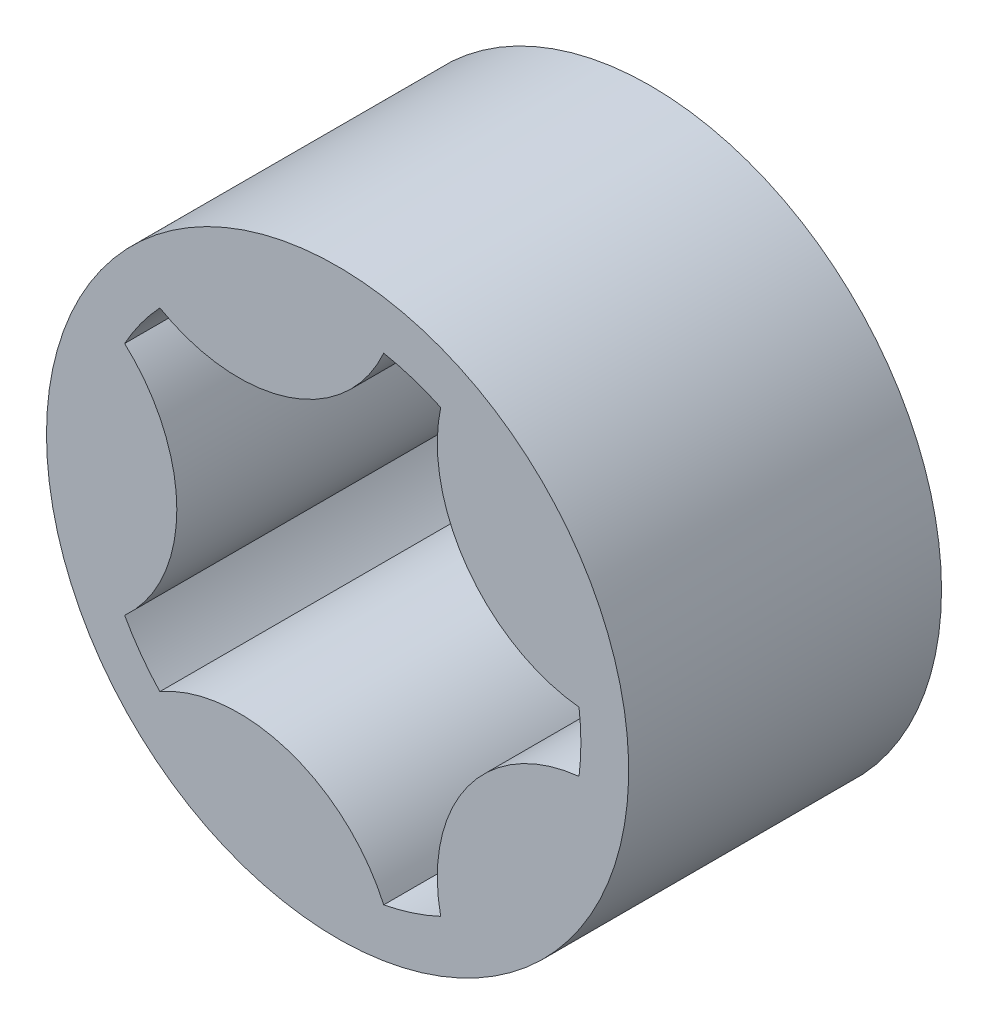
ISO-10303-21;
HEADER;
FILE_DESCRIPTION(('STEP AP214'),'2;1');
FILE_NAME('part.step','',(''),(''),'','','');
FILE_SCHEMA(('AUTOMOTIVE_DESIGN { 1 0 10303 214 1 1 1 1 }'));
ENDSEC;
DATA;
#1=APPLICATION_CONTEXT('core data for automotive mechanical design processes');
#2=APPLICATION_PROTOCOL_DEFINITION('international standard','automotive_design',2000,#1);
#3=PRODUCT_CONTEXT('',#1,'mechanical');
#4=PRODUCT('Part','Part','',(#3));
#5=PRODUCT_RELATED_PRODUCT_CATEGORY('part','',(#4));
#6=PRODUCT_DEFINITION_FORMATION('','',#4);
#7=PRODUCT_DEFINITION_CONTEXT('part definition',#1,'design');
#8=PRODUCT_DEFINITION('design','',#6,#7);
#9=PRODUCT_DEFINITION_SHAPE('','',#8);
#10=(LENGTH_UNIT() NAMED_UNIT(*) SI_UNIT(.MILLI.,.METRE.));
#11=(NAMED_UNIT(*) PLANE_ANGLE_UNIT() SI_UNIT($,.RADIAN.));
#12=(NAMED_UNIT(*) SI_UNIT($,.STERADIAN.) SOLID_ANGLE_UNIT());
#13=UNCERTAINTY_MEASURE_WITH_UNIT(LENGTH_MEASURE(1.E-05),#10,'distance_accuracy_value','');
#14=(GEOMETRIC_REPRESENTATION_CONTEXT(3) GLOBAL_UNCERTAINTY_ASSIGNED_CONTEXT((#13)) GLOBAL_UNIT_ASSIGNED_CONTEXT((#10,
#11,#12)) REPRESENTATION_CONTEXT('',''));
#15=CARTESIAN_POINT('',(0.,0.,0.));
#16=DIRECTION('',(0.,0.,1.));
#17=DIRECTION('',(1.,0.,0.));
#18=AXIS2_PLACEMENT_3D('',#15,#16,#17);
#19=CARTESIAN_POINT('',(0.,0.,0.));
#20=DIRECTION('',(0.,0.,1.));
#21=DIRECTION('',(1.,0.,0.));
#22=AXIS2_PLACEMENT_3D('',#19,#20,#21);
#23=PLANE('',#22);
#24=CARTESIAN_POINT('',(0.,0.,0.));
#25=DIRECTION('',(0.,0.,1.));
#26=DIRECTION('',(1.,0.,0.));
#27=AXIS2_PLACEMENT_3D('',#24,#25,#26);
#28=CIRCLE('',#27,33.5);
#29=CARTESIAN_POINT('',(33.5,0.,0.));
#30=VERTEX_POINT('',#29);
#31=EDGE_CURVE('E116',#30,#30,#28,.T.);
#32=ORIENTED_EDGE('',*,*,#31,.F.);
#33=EDGE_LOOP('',(#32));
#34=FACE_BOUND('',#33,.T.);
#35=CARTESIAN_POINT('',(-36.7773152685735,0.,0.));
#36=DIRECTION('',(0.,0.,-1.));
#37=DIRECTION('',(-1.,0.,0.));
#38=AXIS2_PLACEMENT_3D('',#35,#36,#37);
#39=CIRCLE('',#38,18.2773152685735);
#40=CARTESIAN_POINT('',(-24.505740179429,13.5450617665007,0.));
#41=VERTEX_POINT('',#40);
#42=CARTESIAN_POINT('',(-24.505740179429,-13.5450617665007,0.));
#43=VERTEX_POINT('',#42);
#44=EDGE_CURVE('E113',#41,#43,#39,.T.);
#45=ORIENTED_EDGE('',*,*,#44,.T.);
#46=CARTESIAN_POINT('',(0.,0.,0.));
#47=DIRECTION('',(0.,0.,1.));
#48=DIRECTION('',(1.,0.,0.));
#49=AXIS2_PLACEMENT_3D('',#46,#47,#48);
#50=CIRCLE('',#49,28.);
#51=CARTESIAN_POINT('',(-20.4548094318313,-19.1206896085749,0.));
#52=VERTEX_POINT('',#51);
#53=EDGE_CURVE('E119',#43,#52,#50,.T.);
#54=ORIENTED_EDGE('',*,*,#53,.T.);
#55=CARTESIAN_POINT('',(-11.3648154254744,-34.977305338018,0.));
#56=DIRECTION('',(0.,0.,-1.));
#57=DIRECTION('',(-1.,0.,0.));
#58=AXIS2_PLACEMENT_3D('',#55,#56,#57);
#59=CIRCLE('',#58,18.2773152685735);
#60=CARTESIAN_POINT('',(5.30942908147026,-27.491998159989,0.));
#61=VERTEX_POINT('',#60);
#62=EDGE_CURVE('E123',#52,#61,#59,.T.);
#63=ORIENTED_EDGE('',*,*,#62,.T.);
#64=CARTESIAN_POINT('',(0.,0.,0.));
#65=DIRECTION('',(0.,0.,1.));
#66=DIRECTION('',(1.,0.,0.));
#67=AXIS2_PLACEMENT_3D('',#64,#65,#66);
#68=CIRCLE('',#67,28.);
#69=CARTESIAN_POINT('',(11.8639727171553,-25.3622978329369,0.));
#70=VERTEX_POINT('',#69);
#71=EDGE_CURVE('E194',#61,#70,#68,.T.);
#72=ORIENTED_EDGE('',*,*,#71,.T.);
#73=CARTESIAN_POINT('',(29.7534730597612,-21.6171635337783,0.));
#74=DIRECTION('',(0.,0.,-1.));
#75=DIRECTION('',(-1.,0.,0.));
#76=AXIS2_PLACEMENT_3D('',#73,#74,#75);
#77=CIRCLE('',#76,18.2773152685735);
#78=CARTESIAN_POINT('',(27.7871478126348,-3.4459275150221,0.));
#79=VERTEX_POINT('',#78);
#80=EDGE_CURVE('E191',#70,#79,#77,.T.);
#81=ORIENTED_EDGE('',*,*,#80,.T.);
#82=CARTESIAN_POINT('',(0.,0.,0.));
#83=DIRECTION('',(0.,0.,1.));
#84=DIRECTION('',(1.,0.,0.));
#85=AXIS2_PLACEMENT_3D('',#82,#83,#84);
#86=CIRCLE('',#85,28.);
#87=CARTESIAN_POINT('',(27.7871478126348,3.44592751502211,0.));
#88=VERTEX_POINT('',#87);
#89=EDGE_CURVE('E186',#79,#88,#86,.T.);
#90=ORIENTED_EDGE('',*,*,#89,.T.);
#91=CARTESIAN_POINT('',(29.7534730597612,21.6171635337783,0.));
#92=DIRECTION('',(0.,0.,-1.));
#93=DIRECTION('',(-1.,0.,0.));
#94=AXIS2_PLACEMENT_3D('',#91,#92,#93);
#95=CIRCLE('',#94,18.2773152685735);
#96=CARTESIAN_POINT('',(11.8639727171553,25.3622978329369,0.));
#97=VERTEX_POINT('',#96);
#98=EDGE_CURVE('E184',#88,#97,#95,.T.);
#99=ORIENTED_EDGE('',*,*,#98,.T.);
#100=CARTESIAN_POINT('',(0.,0.,0.));
#101=DIRECTION('',(0.,0.,1.));
#102=DIRECTION('',(1.,0.,0.));
#103=AXIS2_PLACEMENT_3D('',#100,#101,#102);
#104=CIRCLE('',#103,28.);
#105=CARTESIAN_POINT('',(5.30942908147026,27.491998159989,0.));
#106=VERTEX_POINT('',#105);
#107=EDGE_CURVE('E179',#97,#106,#104,.T.);
#108=ORIENTED_EDGE('',*,*,#107,.T.);
#109=CARTESIAN_POINT('',(-11.3648154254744,34.977305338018,0.));
#110=DIRECTION('',(0.,0.,-1.));
#111=DIRECTION('',(-1.,0.,0.));
#112=AXIS2_PLACEMENT_3D('',#109,#110,#111);
#113=CIRCLE('',#112,18.2773152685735);
#114=CARTESIAN_POINT('',(-20.4548094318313,19.1206896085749,0.));
#115=VERTEX_POINT('',#114);
#116=EDGE_CURVE('E177',#106,#115,#113,.T.);
#117=ORIENTED_EDGE('',*,*,#116,.T.);
#118=CARTESIAN_POINT('',(0.,0.,0.));
#119=DIRECTION('',(0.,0.,1.));
#120=DIRECTION('',(1.,0.,0.));
#121=AXIS2_PLACEMENT_3D('',#118,#119,#120);
#122=CIRCLE('',#121,28.);
#123=EDGE_CURVE('E127',#115,#41,#122,.T.);
#124=ORIENTED_EDGE('',*,*,#123,.T.);
#125=EDGE_LOOP('',(#45,#54,#63,#72,#81,#90,#99,#108,#117,#124));
#126=FACE_BOUND('',#125,.T.);
#127=ADVANCED_FACE('F31',(#34,#126),#23,.F.);
#128=CARTESIAN_POINT('',(0.,0.,130.752308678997));
#129=DIRECTION('',(0.,0.,-1.));
#130=DIRECTION('',(-1.,0.,0.));
#131=AXIS2_PLACEMENT_3D('',#128,#129,#130);
#132=CYLINDRICAL_SURFACE('',#131,33.5);
#133=CARTESIAN_POINT('',(0.,0.,36.));
#134=DIRECTION('',(0.,0.,-1.));
#135=DIRECTION('',(-1.,0.,0.));
#136=AXIS2_PLACEMENT_3D('',#133,#134,#135);
#137=CIRCLE('',#136,33.5);
#138=CARTESIAN_POINT('',(-33.5,0.,36.));
#139=VERTEX_POINT('',#138);
#140=EDGE_CURVE('E131',#139,#139,#137,.T.);
#141=ORIENTED_EDGE('',*,*,#140,.T.);
#142=EDGE_LOOP('',(#141));
#143=FACE_BOUND('',#142,.T.);
#144=ORIENTED_EDGE('',*,*,#31,.T.);
#145=EDGE_LOOP('',(#144));
#146=FACE_BOUND('',#145,.T.);
#147=ADVANCED_FACE('F226',(#143,#146),#132,.T.);
#148=CARTESIAN_POINT('',(-36.7773152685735,0.,130.752308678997));
#149=DIRECTION('',(0.,0.,-1.));
#150=DIRECTION('',(-1.,0.,0.));
#151=AXIS2_PLACEMENT_3D('',#148,#149,#150);
#152=CYLINDRICAL_SURFACE('',#151,18.2773152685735);
#153=CARTESIAN_POINT('',(-36.7773152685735,0.,36.));
#154=DIRECTION('',(0.,0.,-1.));
#155=DIRECTION('',(-1.,0.,0.));
#156=AXIS2_PLACEMENT_3D('',#153,#154,#155);
#157=CIRCLE('',#156,18.2773152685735);
#158=CARTESIAN_POINT('',(-24.505740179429,-13.5450617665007,36.));
#159=VERTEX_POINT('',#158);
#160=CARTESIAN_POINT('',(-24.505740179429,13.5450617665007,36.));
#161=VERTEX_POINT('',#160);
#162=EDGE_CURVE('E115',#159,#161,#157,.F.);
#163=ORIENTED_EDGE('',*,*,#162,.F.);
#164=DIRECTION('',(0.,0.,-1.));
#165=VECTOR('',#164,1.);
#166=CARTESIAN_POINT('',(-24.505740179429,-13.5450617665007,130.752308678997));
#167=LINE('',#166,#165);
#168=EDGE_CURVE('E109',#159,#43,#167,.T.);
#169=ORIENTED_EDGE('',*,*,#168,.T.);
#170=ORIENTED_EDGE('',*,*,#44,.F.);
#171=DIRECTION('',(0.,0.,-1.));
#172=VECTOR('',#171,1.);
#173=CARTESIAN_POINT('',(-24.505740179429,13.5450617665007,130.752308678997));
#174=LINE('',#173,#172);
#175=EDGE_CURVE('E151',#161,#41,#174,.T.);
#176=ORIENTED_EDGE('',*,*,#175,.F.);
#177=EDGE_LOOP('',(#163,#169,#170,#176));
#178=FACE_BOUND('',#177,.T.);
#179=ADVANCED_FACE('F110',(#178),#152,.T.);
#180=CARTESIAN_POINT('',(0.,0.,130.752308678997));
#181=DIRECTION('',(0.,0.,-1.));
#182=DIRECTION('',(-1.,0.,0.));
#183=AXIS2_PLACEMENT_3D('',#180,#181,#182);
#184=CYLINDRICAL_SURFACE('',#183,28.);
#185=CARTESIAN_POINT('',(0.,0.,36.));
#186=DIRECTION('',(0.,0.,-1.));
#187=DIRECTION('',(-1.,0.,0.));
#188=AXIS2_PLACEMENT_3D('',#185,#186,#187);
#189=CIRCLE('',#188,28.);
#190=CARTESIAN_POINT('',(-20.4548094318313,-19.1206896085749,36.));
#191=VERTEX_POINT('',#190);
#192=EDGE_CURVE('E11',#191,#159,#189,.T.);
#193=ORIENTED_EDGE('',*,*,#192,.F.);
#194=DIRECTION('',(0.,0.,-1.));
#195=VECTOR('',#194,1.);
#196=CARTESIAN_POINT('',(-20.4548094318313,-19.1206896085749,130.752308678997));
#197=LINE('',#196,#195);
#198=EDGE_CURVE('E103',#191,#52,#197,.T.);
#199=ORIENTED_EDGE('',*,*,#198,.T.);
#200=ORIENTED_EDGE('',*,*,#53,.F.);
#201=ORIENTED_EDGE('',*,*,#168,.F.);
#202=EDGE_LOOP('',(#193,#199,#200,#201));
#203=FACE_BOUND('',#202,.T.);
#204=ADVANCED_FACE('F120',(#203),#184,.F.);
#205=CARTESIAN_POINT('',(-11.3648154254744,-34.977305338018,130.752308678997));
#206=DIRECTION('',(0.,0.,-1.));
#207=DIRECTION('',(-1.,0.,0.));
#208=AXIS2_PLACEMENT_3D('',#205,#206,#207);
#209=CYLINDRICAL_SURFACE('',#208,18.2773152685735);
#210=CARTESIAN_POINT('',(-11.3648154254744,-34.977305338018,36.));
#211=DIRECTION('',(0.,0.,-1.));
#212=DIRECTION('',(-1.,0.,0.));
#213=AXIS2_PLACEMENT_3D('',#210,#211,#212);
#214=CIRCLE('',#213,18.2773152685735);
#215=CARTESIAN_POINT('',(5.30942908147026,-27.491998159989,36.));
#216=VERTEX_POINT('',#215);
#217=EDGE_CURVE('E41',#216,#191,#214,.F.);
#218=ORIENTED_EDGE('',*,*,#217,.F.);
#219=DIRECTION('',(0.,0.,-1.));
#220=VECTOR('',#219,1.);
#221=CARTESIAN_POINT('',(5.30942908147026,-27.491998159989,130.752308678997));
#222=LINE('',#221,#220);
#223=EDGE_CURVE('E137',#216,#61,#222,.T.);
#224=ORIENTED_EDGE('',*,*,#223,.T.);
#225=ORIENTED_EDGE('',*,*,#62,.F.);
#226=ORIENTED_EDGE('',*,*,#198,.F.);
#227=EDGE_LOOP('',(#218,#224,#225,#226));
#228=FACE_BOUND('',#227,.T.);
#229=ADVANCED_FACE('F199',(#228),#209,.T.);
#230=CARTESIAN_POINT('',(0.,0.,130.752308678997));
#231=DIRECTION('',(0.,0.,-1.));
#232=DIRECTION('',(-1.,0.,0.));
#233=AXIS2_PLACEMENT_3D('',#230,#231,#232);
#234=CYLINDRICAL_SURFACE('',#233,28.);
#235=CARTESIAN_POINT('',(0.,0.,36.));
#236=DIRECTION('',(0.,0.,-1.));
#237=DIRECTION('',(-1.,0.,0.));
#238=AXIS2_PLACEMENT_3D('',#235,#236,#237);
#239=CIRCLE('',#238,28.);
#240=CARTESIAN_POINT('',(11.8639727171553,-25.3622978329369,36.));
#241=VERTEX_POINT('',#240);
#242=EDGE_CURVE('E155',#241,#216,#239,.T.);
#243=ORIENTED_EDGE('',*,*,#242,.F.);
#244=DIRECTION('',(0.,0.,-1.));
#245=VECTOR('',#244,1.);
#246=CARTESIAN_POINT('',(11.8639727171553,-25.3622978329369,130.752308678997));
#247=LINE('',#246,#245);
#248=EDGE_CURVE('E139',#241,#70,#247,.T.);
#249=ORIENTED_EDGE('',*,*,#248,.T.);
#250=ORIENTED_EDGE('',*,*,#71,.F.);
#251=ORIENTED_EDGE('',*,*,#223,.F.);
#252=EDGE_LOOP('',(#243,#249,#250,#251));
#253=FACE_BOUND('',#252,.T.);
#254=ADVANCED_FACE('F203',(#253),#234,.F.);
#255=CARTESIAN_POINT('',(29.7534730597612,-21.6171635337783,130.752308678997));
#256=DIRECTION('',(0.,0.,-1.));
#257=DIRECTION('',(-1.,0.,0.));
#258=AXIS2_PLACEMENT_3D('',#255,#256,#257);
#259=CYLINDRICAL_SURFACE('',#258,18.2773152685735);
#260=CARTESIAN_POINT('',(29.7534730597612,-21.6171635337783,36.));
#261=DIRECTION('',(0.,0.,-1.));
#262=DIRECTION('',(-1.,0.,0.));
#263=AXIS2_PLACEMENT_3D('',#260,#261,#262);
#264=CIRCLE('',#263,18.2773152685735);
#265=CARTESIAN_POINT('',(27.7871478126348,-3.4459275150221,36.));
#266=VERTEX_POINT('',#265);
#267=EDGE_CURVE('E157',#266,#241,#264,.F.);
#268=ORIENTED_EDGE('',*,*,#267,.F.);
#269=DIRECTION('',(0.,0.,-1.));
#270=VECTOR('',#269,1.);
#271=CARTESIAN_POINT('',(27.7871478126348,-3.4459275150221,130.752308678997));
#272=LINE('',#271,#270);
#273=EDGE_CURVE('E141',#266,#79,#272,.T.);
#274=ORIENTED_EDGE('',*,*,#273,.T.);
#275=ORIENTED_EDGE('',*,*,#80,.F.);
#276=ORIENTED_EDGE('',*,*,#248,.F.);
#277=EDGE_LOOP('',(#268,#274,#275,#276));
#278=FACE_BOUND('',#277,.T.);
#279=ADVANCED_FACE('F208',(#278),#259,.T.);
#280=CARTESIAN_POINT('',(0.,0.,130.752308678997));
#281=DIRECTION('',(0.,0.,-1.));
#282=DIRECTION('',(-1.,0.,0.));
#283=AXIS2_PLACEMENT_3D('',#280,#281,#282);
#284=CYLINDRICAL_SURFACE('',#283,28.);
#285=CARTESIAN_POINT('',(0.,0.,36.));
#286=DIRECTION('',(0.,0.,-1.));
#287=DIRECTION('',(-1.,0.,0.));
#288=AXIS2_PLACEMENT_3D('',#285,#286,#287);
#289=CIRCLE('',#288,28.);
#290=CARTESIAN_POINT('',(27.7871478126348,3.44592751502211,36.));
#291=VERTEX_POINT('',#290);
#292=EDGE_CURVE('E159',#291,#266,#289,.T.);
#293=ORIENTED_EDGE('',*,*,#292,.F.);
#294=DIRECTION('',(0.,0.,-1.));
#295=VECTOR('',#294,1.);
#296=CARTESIAN_POINT('',(27.7871478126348,3.44592751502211,130.752308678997));
#297=LINE('',#296,#295);
#298=EDGE_CURVE('E143',#291,#88,#297,.T.);
#299=ORIENTED_EDGE('',*,*,#298,.T.);
#300=ORIENTED_EDGE('',*,*,#89,.F.);
#301=ORIENTED_EDGE('',*,*,#273,.F.);
#302=EDGE_LOOP('',(#293,#299,#300,#301));
#303=FACE_BOUND('',#302,.T.);
#304=ADVANCED_FACE('F213',(#303),#284,.F.);
#305=CARTESIAN_POINT('',(29.7534730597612,21.6171635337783,130.752308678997));
#306=DIRECTION('',(0.,0.,-1.));
#307=DIRECTION('',(-1.,0.,0.));
#308=AXIS2_PLACEMENT_3D('',#305,#306,#307);
#309=CYLINDRICAL_SURFACE('',#308,18.2773152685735);
#310=CARTESIAN_POINT('',(29.7534730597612,21.6171635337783,36.));
#311=DIRECTION('',(0.,0.,-1.));
#312=DIRECTION('',(-1.,0.,0.));
#313=AXIS2_PLACEMENT_3D('',#310,#311,#312);
#314=CIRCLE('',#313,18.2773152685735);
#315=CARTESIAN_POINT('',(11.8639727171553,25.3622978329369,36.));
#316=VERTEX_POINT('',#315);
#317=EDGE_CURVE('E161',#316,#291,#314,.F.);
#318=ORIENTED_EDGE('',*,*,#317,.F.);
#319=DIRECTION('',(0.,0.,-1.));
#320=VECTOR('',#319,1.);
#321=CARTESIAN_POINT('',(11.8639727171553,25.3622978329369,130.752308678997));
#322=LINE('',#321,#320);
#323=EDGE_CURVE('E145',#316,#97,#322,.T.);
#324=ORIENTED_EDGE('',*,*,#323,.T.);
#325=ORIENTED_EDGE('',*,*,#98,.F.);
#326=ORIENTED_EDGE('',*,*,#298,.F.);
#327=EDGE_LOOP('',(#318,#324,#325,#326));
#328=FACE_BOUND('',#327,.T.);
#329=ADVANCED_FACE('F216',(#328),#309,.T.);
#330=CARTESIAN_POINT('',(0.,0.,130.752308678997));
#331=DIRECTION('',(0.,0.,-1.));
#332=DIRECTION('',(-1.,0.,0.));
#333=AXIS2_PLACEMENT_3D('',#330,#331,#332);
#334=CYLINDRICAL_SURFACE('',#333,28.);
#335=CARTESIAN_POINT('',(0.,0.,36.));
#336=DIRECTION('',(0.,0.,-1.));
#337=DIRECTION('',(-1.,0.,0.));
#338=AXIS2_PLACEMENT_3D('',#335,#336,#337);
#339=CIRCLE('',#338,28.);
#340=CARTESIAN_POINT('',(5.30942908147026,27.491998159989,36.));
#341=VERTEX_POINT('',#340);
#342=EDGE_CURVE('E162',#341,#316,#339,.T.);
#343=ORIENTED_EDGE('',*,*,#342,.F.);
#344=DIRECTION('',(0.,0.,-1.));
#345=VECTOR('',#344,1.);
#346=CARTESIAN_POINT('',(5.30942908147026,27.491998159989,130.752308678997));
#347=LINE('',#346,#345);
#348=EDGE_CURVE('E147',#341,#106,#347,.T.);
#349=ORIENTED_EDGE('',*,*,#348,.T.);
#350=ORIENTED_EDGE('',*,*,#107,.F.);
#351=ORIENTED_EDGE('',*,*,#323,.F.);
#352=EDGE_LOOP('',(#343,#349,#350,#351));
#353=FACE_BOUND('',#352,.T.);
#354=ADVANCED_FACE('F173',(#353),#334,.F.);
#355=CARTESIAN_POINT('',(-11.3648154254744,34.977305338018,130.752308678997));
#356=DIRECTION('',(0.,0.,-1.));
#357=DIRECTION('',(-1.,0.,0.));
#358=AXIS2_PLACEMENT_3D('',#355,#356,#357);
#359=CYLINDRICAL_SURFACE('',#358,18.2773152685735);
#360=CARTESIAN_POINT('',(-11.3648154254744,34.977305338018,36.));
#361=DIRECTION('',(0.,0.,-1.));
#362=DIRECTION('',(-1.,0.,0.));
#363=AXIS2_PLACEMENT_3D('',#360,#361,#362);
#364=CIRCLE('',#363,18.2773152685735);
#365=CARTESIAN_POINT('',(-20.4548094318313,19.1206896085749,36.));
#366=VERTEX_POINT('',#365);
#367=EDGE_CURVE('E35',#366,#341,#364,.F.);
#368=ORIENTED_EDGE('',*,*,#367,.F.);
#369=DIRECTION('',(0.,0.,-1.));
#370=VECTOR('',#369,1.);
#371=CARTESIAN_POINT('',(-20.4548094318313,19.1206896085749,130.752308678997));
#372=LINE('',#371,#370);
#373=EDGE_CURVE('E149',#366,#115,#372,.T.);
#374=ORIENTED_EDGE('',*,*,#373,.T.);
#375=ORIENTED_EDGE('',*,*,#116,.F.);
#376=ORIENTED_EDGE('',*,*,#348,.F.);
#377=EDGE_LOOP('',(#368,#374,#375,#376));
#378=FACE_BOUND('',#377,.T.);
#379=ADVANCED_FACE('F176',(#378),#359,.T.);
#380=CARTESIAN_POINT('',(0.,0.,130.752308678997));
#381=DIRECTION('',(0.,0.,-1.));
#382=DIRECTION('',(-1.,0.,0.));
#383=AXIS2_PLACEMENT_3D('',#380,#381,#382);
#384=CYLINDRICAL_SURFACE('',#383,28.);
#385=CARTESIAN_POINT('',(0.,0.,36.));
#386=DIRECTION('',(0.,0.,-1.));
#387=DIRECTION('',(-1.,0.,0.));
#388=AXIS2_PLACEMENT_3D('',#385,#386,#387);
#389=CIRCLE('',#388,28.);
#390=EDGE_CURVE('E134',#161,#366,#389,.T.);
#391=ORIENTED_EDGE('',*,*,#390,.F.);
#392=ORIENTED_EDGE('',*,*,#175,.T.);
#393=ORIENTED_EDGE('',*,*,#123,.F.);
#394=ORIENTED_EDGE('',*,*,#373,.F.);
#395=EDGE_LOOP('',(#391,#392,#393,#394));
#396=FACE_BOUND('',#395,.T.);
#397=ADVANCED_FACE('F236',(#396),#384,.F.);
#398=CARTESIAN_POINT('',(-17.7881605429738,12.9154887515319,36.));
#399=DIRECTION('',(0.,0.,-1.));
#400=DIRECTION('',(-1.,0.,0.));
#401=AXIS2_PLACEMENT_3D('',#398,#399,#400);
#402=PLANE('',#401);
#403=ORIENTED_EDGE('',*,*,#162,.T.);
#404=ORIENTED_EDGE('',*,*,#390,.T.);
#405=ORIENTED_EDGE('',*,*,#367,.T.);
#406=ORIENTED_EDGE('',*,*,#342,.T.);
#407=ORIENTED_EDGE('',*,*,#317,.T.);
#408=ORIENTED_EDGE('',*,*,#292,.T.);
#409=ORIENTED_EDGE('',*,*,#267,.T.);
#410=ORIENTED_EDGE('',*,*,#242,.T.);
#411=ORIENTED_EDGE('',*,*,#217,.T.);
#412=ORIENTED_EDGE('',*,*,#192,.T.);
#413=EDGE_LOOP('',(#403,#404,#405,#406,#407,#408,#409,#410,#411,#412));
#414=FACE_BOUND('',#413,.T.);
#415=ORIENTED_EDGE('',*,*,#140,.F.);
#416=EDGE_LOOP('',(#415));
#417=FACE_BOUND('',#416,.T.);
#418=ADVANCED_FACE('F33',(#414,#417),#402,.F.);
#419=CLOSED_SHELL('',(#127,#147,#179,#204,#229,#254,#279,#304,#329,#354,#379,#397,#418));
#420=MANIFOLD_SOLID_BREP('B2',#419);
#421=ADVANCED_BREP_SHAPE_REPRESENTATION('',(#18,#420),#14);
#422=SHAPE_DEFINITION_REPRESENTATION(#9,#421);
ENDSEC;
END-ISO-10303-21;
